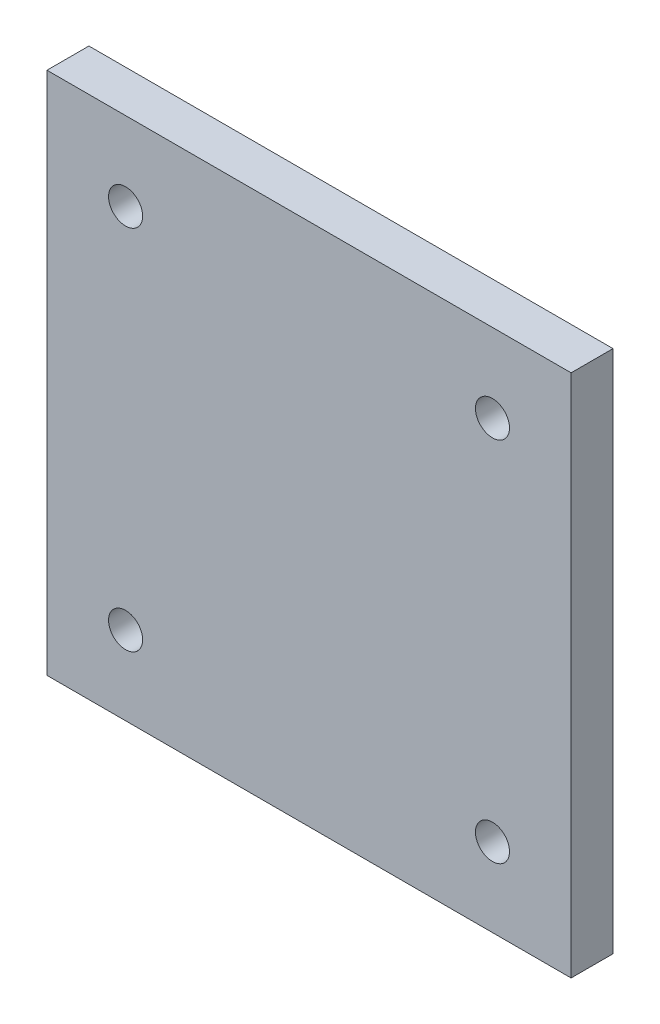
ISO-10303-21;
HEADER;
FILE_DESCRIPTION(('STEP AP214'),'2;1');
FILE_NAME('part.step','',(''),(''),'','','');
FILE_SCHEMA(('AUTOMOTIVE_DESIGN { 1 0 10303 214 1 1 1 1 }'));
ENDSEC;
DATA;
#1=APPLICATION_CONTEXT('core data for automotive mechanical design processes');
#2=APPLICATION_PROTOCOL_DEFINITION('international standard','automotive_design',2000,#1);
#3=PRODUCT_CONTEXT('',#1,'mechanical');
#4=PRODUCT('Part','Part','',(#3));
#5=PRODUCT_RELATED_PRODUCT_CATEGORY('part','',(#4));
#6=PRODUCT_DEFINITION_FORMATION('','',#4);
#7=PRODUCT_DEFINITION_CONTEXT('part definition',#1,'design');
#8=PRODUCT_DEFINITION('design','',#6,#7);
#9=PRODUCT_DEFINITION_SHAPE('','',#8);
#10=(LENGTH_UNIT() NAMED_UNIT(*) SI_UNIT(.MILLI.,.METRE.));
#11=(NAMED_UNIT(*) PLANE_ANGLE_UNIT() SI_UNIT($,.RADIAN.));
#12=(NAMED_UNIT(*) SI_UNIT($,.STERADIAN.) SOLID_ANGLE_UNIT());
#13=UNCERTAINTY_MEASURE_WITH_UNIT(LENGTH_MEASURE(1.E-05),#10,'distance_accuracy_value','');
#14=(GEOMETRIC_REPRESENTATION_CONTEXT(3) GLOBAL_UNCERTAINTY_ASSIGNED_CONTEXT((#13)) GLOBAL_UNIT_ASSIGNED_CONTEXT((#10,
#11,#12)) REPRESENTATION_CONTEXT('',''));
#15=CARTESIAN_POINT('',(0.,0.,0.));
#16=DIRECTION('',(0.,0.,1.));
#17=DIRECTION('',(1.,0.,0.));
#18=AXIS2_PLACEMENT_3D('',#15,#16,#17);
#19=CARTESIAN_POINT('',(0.,0.,16.));
#20=DIRECTION('',(0.,0.,1.));
#21=DIRECTION('',(1.,0.,0.));
#22=AXIS2_PLACEMENT_3D('',#19,#20,#21);
#23=PLANE('',#22);
#24=CARTESIAN_POINT('',(70.,70.,16.));
#25=DIRECTION('',(0.,0.,1.));
#26=DIRECTION('',(1.,0.,0.));
#27=AXIS2_PLACEMENT_3D('',#24,#25,#26);
#28=CIRCLE('',#27,6.5);
#29=CARTESIAN_POINT('',(76.5,70.,16.));
#30=VERTEX_POINT('',#29);
#31=EDGE_CURVE('E24',#30,#30,#28,.T.);
#32=ORIENTED_EDGE('',*,*,#31,.F.);
#33=EDGE_LOOP('',(#32));
#34=FACE_BOUND('',#33,.T.);
#35=CARTESIAN_POINT('',(-70.,70.,16.));
#36=DIRECTION('',(0.,0.,1.));
#37=DIRECTION('',(1.,0.,0.));
#38=AXIS2_PLACEMENT_3D('',#35,#36,#37);
#39=CIRCLE('',#38,6.5);
#40=CARTESIAN_POINT('',(-63.5,70.,16.));
#41=VERTEX_POINT('',#40);
#42=EDGE_CURVE('E121',#41,#41,#39,.T.);
#43=ORIENTED_EDGE('',*,*,#42,.F.);
#44=EDGE_LOOP('',(#43));
#45=FACE_BOUND('',#44,.T.);
#46=CARTESIAN_POINT('',(70.,-70.,16.));
#47=DIRECTION('',(0.,0.,1.));
#48=DIRECTION('',(1.,0.,0.));
#49=AXIS2_PLACEMENT_3D('',#46,#47,#48);
#50=CIRCLE('',#49,6.5);
#51=CARTESIAN_POINT('',(76.5,-70.,16.));
#52=VERTEX_POINT('',#51);
#53=EDGE_CURVE('E99',#52,#52,#50,.T.);
#54=ORIENTED_EDGE('',*,*,#53,.F.);
#55=EDGE_LOOP('',(#54));
#56=FACE_BOUND('',#55,.T.);
#57=CARTESIAN_POINT('',(-70.,-70.,16.));
#58=DIRECTION('',(0.,0.,1.));
#59=DIRECTION('',(1.,0.,0.));
#60=AXIS2_PLACEMENT_3D('',#57,#58,#59);
#61=CIRCLE('',#60,6.5);
#62=CARTESIAN_POINT('',(-63.5,-70.,16.));
#63=VERTEX_POINT('',#62);
#64=EDGE_CURVE('E271',#63,#63,#61,.T.);
#65=ORIENTED_EDGE('',*,*,#64,.F.);
#66=EDGE_LOOP('',(#65));
#67=FACE_BOUND('',#66,.T.);
#68=DIRECTION('',(1.,0.,0.));
#69=VECTOR('',#68,1.);
#70=CARTESIAN_POINT('',(-100.,-100.,16.));
#71=LINE('',#70,#69);
#72=CARTESIAN_POINT('',(-100.,-100.,16.));
#73=VERTEX_POINT('',#72);
#74=CARTESIAN_POINT('',(100.,-100.,16.));
#75=VERTEX_POINT('',#74);
#76=EDGE_CURVE('E240',#73,#75,#71,.T.);
#77=ORIENTED_EDGE('',*,*,#76,.T.);
#78=DIRECTION('',(0.,1.,0.));
#79=VECTOR('',#78,1.);
#80=CARTESIAN_POINT('',(100.,-100.,16.));
#81=LINE('',#80,#79);
#82=CARTESIAN_POINT('',(100.,100.,16.));
#83=VERTEX_POINT('',#82);
#84=EDGE_CURVE('E264',#75,#83,#81,.T.);
#85=ORIENTED_EDGE('',*,*,#84,.T.);
#86=DIRECTION('',(-1.,0.,0.));
#87=VECTOR('',#86,1.);
#88=CARTESIAN_POINT('',(100.,100.,16.));
#89=LINE('',#88,#87);
#90=CARTESIAN_POINT('',(-100.,100.,16.));
#91=VERTEX_POINT('',#90);
#92=EDGE_CURVE('E234',#83,#91,#89,.T.);
#93=ORIENTED_EDGE('',*,*,#92,.T.);
#94=DIRECTION('',(0.,-1.,0.));
#95=VECTOR('',#94,1.);
#96=CARTESIAN_POINT('',(-100.,100.,16.));
#97=LINE('',#96,#95);
#98=EDGE_CURVE('E233',#91,#73,#97,.T.);
#99=ORIENTED_EDGE('',*,*,#98,.T.);
#100=EDGE_LOOP('',(#77,#85,#93,#99));
#101=FACE_BOUND('',#100,.T.);
#102=ADVANCED_FACE('F16',(#34,#45,#56,#67,#101),#23,.T.);
#103=CARTESIAN_POINT('',(0.,0.,0.));
#104=DIRECTION('',(0.,0.,1.));
#105=DIRECTION('',(1.,0.,0.));
#106=AXIS2_PLACEMENT_3D('',#103,#104,#105);
#107=PLANE('',#106);
#108=CARTESIAN_POINT('',(70.,70.,0.));
#109=DIRECTION('',(0.,0.,1.));
#110=DIRECTION('',(1.,0.,0.));
#111=AXIS2_PLACEMENT_3D('',#108,#109,#110);
#112=CIRCLE('',#111,6.5);
#113=CARTESIAN_POINT('',(76.5,70.,0.));
#114=VERTEX_POINT('',#113);
#115=EDGE_CURVE('E10',#114,#114,#112,.T.);
#116=ORIENTED_EDGE('',*,*,#115,.T.);
#117=EDGE_LOOP('',(#116));
#118=FACE_BOUND('',#117,.T.);
#119=CARTESIAN_POINT('',(-70.,70.,0.));
#120=DIRECTION('',(0.,0.,1.));
#121=DIRECTION('',(1.,0.,0.));
#122=AXIS2_PLACEMENT_3D('',#119,#120,#121);
#123=CIRCLE('',#122,6.5);
#124=CARTESIAN_POINT('',(-63.5,70.,0.));
#125=VERTEX_POINT('',#124);
#126=EDGE_CURVE('E124',#125,#125,#123,.T.);
#127=ORIENTED_EDGE('',*,*,#126,.T.);
#128=EDGE_LOOP('',(#127));
#129=FACE_BOUND('',#128,.T.);
#130=CARTESIAN_POINT('',(70.,-70.,0.));
#131=DIRECTION('',(0.,0.,1.));
#132=DIRECTION('',(1.,0.,0.));
#133=AXIS2_PLACEMENT_3D('',#130,#131,#132);
#134=CIRCLE('',#133,6.5);
#135=CARTESIAN_POINT('',(76.5,-70.,0.));
#136=VERTEX_POINT('',#135);
#137=EDGE_CURVE('E105',#136,#136,#134,.T.);
#138=ORIENTED_EDGE('',*,*,#137,.T.);
#139=EDGE_LOOP('',(#138));
#140=FACE_BOUND('',#139,.T.);
#141=CARTESIAN_POINT('',(-70.,-70.,0.));
#142=DIRECTION('',(0.,0.,1.));
#143=DIRECTION('',(1.,0.,0.));
#144=AXIS2_PLACEMENT_3D('',#141,#142,#143);
#145=CIRCLE('',#144,6.5);
#146=CARTESIAN_POINT('',(-63.5,-70.,0.));
#147=VERTEX_POINT('',#146);
#148=EDGE_CURVE('E113',#147,#147,#145,.T.);
#149=ORIENTED_EDGE('',*,*,#148,.T.);
#150=EDGE_LOOP('',(#149));
#151=FACE_BOUND('',#150,.T.);
#152=DIRECTION('',(0.,-1.,0.));
#153=VECTOR('',#152,1.);
#154=CARTESIAN_POINT('',(-100.,100.,0.));
#155=LINE('',#154,#153);
#156=CARTESIAN_POINT('',(-100.,100.,0.));
#157=VERTEX_POINT('',#156);
#158=CARTESIAN_POINT('',(-100.,-100.,0.));
#159=VERTEX_POINT('',#158);
#160=EDGE_CURVE('E223',#157,#159,#155,.T.);
#161=ORIENTED_EDGE('',*,*,#160,.F.);
#162=DIRECTION('',(-1.,0.,0.));
#163=VECTOR('',#162,1.);
#164=CARTESIAN_POINT('',(100.,100.,0.));
#165=LINE('',#164,#163);
#166=CARTESIAN_POINT('',(100.,100.,0.));
#167=VERTEX_POINT('',#166);
#168=EDGE_CURVE('E261',#167,#157,#165,.T.);
#169=ORIENTED_EDGE('',*,*,#168,.F.);
#170=DIRECTION('',(0.,1.,0.));
#171=VECTOR('',#170,1.);
#172=CARTESIAN_POINT('',(100.,-100.,0.));
#173=LINE('',#172,#171);
#174=CARTESIAN_POINT('',(100.,-100.,0.));
#175=VERTEX_POINT('',#174);
#176=EDGE_CURVE('E242',#175,#167,#173,.T.);
#177=ORIENTED_EDGE('',*,*,#176,.F.);
#178=DIRECTION('',(1.,0.,0.));
#179=VECTOR('',#178,1.);
#180=CARTESIAN_POINT('',(-100.,-100.,0.));
#181=LINE('',#180,#179);
#182=EDGE_CURVE('E238',#159,#175,#181,.T.);
#183=ORIENTED_EDGE('',*,*,#182,.F.);
#184=EDGE_LOOP('',(#161,#169,#177,#183));
#185=FACE_BOUND('',#184,.T.);
#186=ADVANCED_FACE('F169',(#118,#129,#140,#151,#185),#107,.F.);
#187=CARTESIAN_POINT('',(70.,70.,0.));
#188=DIRECTION('',(0.,0.,-1.));
#189=DIRECTION('',(1.,0.,0.));
#190=AXIS2_PLACEMENT_3D('',#187,#188,#189);
#191=CYLINDRICAL_SURFACE('',#190,6.5);
#192=DIRECTION('',(0.,0.,1.));
#193=VECTOR('',#192,1.);
#194=CARTESIAN_POINT('',(76.5,70.,0.));
#195=LINE('',#194,#193);
#196=EDGE_CURVE('E127',#114,#30,#195,.T.);
#197=ORIENTED_EDGE('',*,*,#196,.T.);
#198=ORIENTED_EDGE('',*,*,#31,.T.);
#199=ORIENTED_EDGE('',*,*,#196,.F.);
#200=ORIENTED_EDGE('',*,*,#115,.F.);
#201=EDGE_LOOP('',(#197,#198,#199,#200));
#202=FACE_BOUND('',#201,.T.);
#203=ADVANCED_FACE('F141',(#202),#191,.F.);
#204=CARTESIAN_POINT('',(-70.,70.,0.));
#205=DIRECTION('',(0.,0.,-1.));
#206=DIRECTION('',(1.,0.,0.));
#207=AXIS2_PLACEMENT_3D('',#204,#205,#206);
#208=CYLINDRICAL_SURFACE('',#207,6.5);
#209=DIRECTION('',(0.,0.,1.));
#210=VECTOR('',#209,1.);
#211=CARTESIAN_POINT('',(-63.5,70.,0.));
#212=LINE('',#211,#210);
#213=EDGE_CURVE('E110',#125,#41,#212,.T.);
#214=ORIENTED_EDGE('',*,*,#213,.T.);
#215=ORIENTED_EDGE('',*,*,#42,.T.);
#216=ORIENTED_EDGE('',*,*,#213,.F.);
#217=ORIENTED_EDGE('',*,*,#126,.F.);
#218=EDGE_LOOP('',(#214,#215,#216,#217));
#219=FACE_BOUND('',#218,.T.);
#220=ADVANCED_FACE('F136',(#219),#208,.F.);
#221=CARTESIAN_POINT('',(70.,-70.,0.));
#222=DIRECTION('',(0.,0.,-1.));
#223=DIRECTION('',(1.,0.,0.));
#224=AXIS2_PLACEMENT_3D('',#221,#222,#223);
#225=CYLINDRICAL_SURFACE('',#224,6.5);
#226=DIRECTION('',(0.,0.,1.));
#227=VECTOR('',#226,1.);
#228=CARTESIAN_POINT('',(76.5,-70.,0.));
#229=LINE('',#228,#227);
#230=EDGE_CURVE('E102',#136,#52,#229,.T.);
#231=ORIENTED_EDGE('',*,*,#230,.T.);
#232=ORIENTED_EDGE('',*,*,#53,.T.);
#233=ORIENTED_EDGE('',*,*,#230,.F.);
#234=ORIENTED_EDGE('',*,*,#137,.F.);
#235=EDGE_LOOP('',(#231,#232,#233,#234));
#236=FACE_BOUND('',#235,.T.);
#237=ADVANCED_FACE('F100',(#236),#225,.F.);
#238=CARTESIAN_POINT('',(-70.,-70.,0.));
#239=DIRECTION('',(0.,0.,-1.));
#240=DIRECTION('',(1.,0.,0.));
#241=AXIS2_PLACEMENT_3D('',#238,#239,#240);
#242=CYLINDRICAL_SURFACE('',#241,6.5);
#243=DIRECTION('',(0.,0.,1.));
#244=VECTOR('',#243,1.);
#245=CARTESIAN_POINT('',(-63.5,-70.,0.));
#246=LINE('',#245,#244);
#247=EDGE_CURVE('E254',#147,#63,#246,.T.);
#248=ORIENTED_EDGE('',*,*,#247,.T.);
#249=ORIENTED_EDGE('',*,*,#64,.T.);
#250=ORIENTED_EDGE('',*,*,#247,.F.);
#251=ORIENTED_EDGE('',*,*,#148,.F.);
#252=EDGE_LOOP('',(#248,#249,#250,#251));
#253=FACE_BOUND('',#252,.T.);
#254=ADVANCED_FACE('F190',(#253),#242,.F.);
#255=CARTESIAN_POINT('',(-100.,100.,0.));
#256=DIRECTION('',(1.,0.,0.));
#257=DIRECTION('',(0.,1.,0.));
#258=AXIS2_PLACEMENT_3D('',#255,#256,#257);
#259=PLANE('',#258);
#260=ORIENTED_EDGE('',*,*,#160,.T.);
#261=DIRECTION('',(0.,0.,1.));
#262=VECTOR('',#261,1.);
#263=CARTESIAN_POINT('',(-100.,-100.,0.));
#264=LINE('',#263,#262);
#265=EDGE_CURVE('E225',#159,#73,#264,.T.);
#266=ORIENTED_EDGE('',*,*,#265,.T.);
#267=ORIENTED_EDGE('',*,*,#98,.F.);
#268=DIRECTION('',(0.,0.,1.));
#269=VECTOR('',#268,1.);
#270=CARTESIAN_POINT('',(-100.,100.,0.));
#271=LINE('',#270,#269);
#272=EDGE_CURVE('E228',#157,#91,#271,.T.);
#273=ORIENTED_EDGE('',*,*,#272,.F.);
#274=EDGE_LOOP('',(#260,#266,#267,#273));
#275=FACE_BOUND('',#274,.T.);
#276=ADVANCED_FACE('F181',(#275),#259,.F.);
#277=CARTESIAN_POINT('',(100.,100.,0.));
#278=DIRECTION('',(0.,-1.,0.));
#279=DIRECTION('',(0.,0.,-1.));
#280=AXIS2_PLACEMENT_3D('',#277,#278,#279);
#281=PLANE('',#280);
#282=ORIENTED_EDGE('',*,*,#168,.T.);
#283=ORIENTED_EDGE('',*,*,#272,.T.);
#284=ORIENTED_EDGE('',*,*,#92,.F.);
#285=DIRECTION('',(0.,0.,1.));
#286=VECTOR('',#285,1.);
#287=CARTESIAN_POINT('',(100.,100.,0.));
#288=LINE('',#287,#286);
#289=EDGE_CURVE('E260',#167,#83,#288,.T.);
#290=ORIENTED_EDGE('',*,*,#289,.F.);
#291=EDGE_LOOP('',(#282,#283,#284,#290));
#292=FACE_BOUND('',#291,.T.);
#293=ADVANCED_FACE('F163',(#292),#281,.F.);
#294=CARTESIAN_POINT('',(100.,-100.,0.));
#295=DIRECTION('',(-1.,0.,0.));
#296=DIRECTION('',(0.,0.,1.));
#297=AXIS2_PLACEMENT_3D('',#294,#295,#296);
#298=PLANE('',#297);
#299=ORIENTED_EDGE('',*,*,#176,.T.);
#300=ORIENTED_EDGE('',*,*,#289,.T.);
#301=ORIENTED_EDGE('',*,*,#84,.F.);
#302=DIRECTION('',(0.,0.,1.));
#303=VECTOR('',#302,1.);
#304=CARTESIAN_POINT('',(100.,-100.,0.));
#305=LINE('',#304,#303);
#306=EDGE_CURVE('E247',#175,#75,#305,.T.);
#307=ORIENTED_EDGE('',*,*,#306,.F.);
#308=EDGE_LOOP('',(#299,#300,#301,#307));
#309=FACE_BOUND('',#308,.T.);
#310=ADVANCED_FACE('F154',(#309),#298,.F.);
#311=CARTESIAN_POINT('',(-100.,-100.,0.));
#312=DIRECTION('',(0.,1.,0.));
#313=DIRECTION('',(1.,0.,0.));
#314=AXIS2_PLACEMENT_3D('',#311,#312,#313);
#315=PLANE('',#314);
#316=ORIENTED_EDGE('',*,*,#182,.T.);
#317=ORIENTED_EDGE('',*,*,#306,.T.);
#318=ORIENTED_EDGE('',*,*,#76,.F.);
#319=ORIENTED_EDGE('',*,*,#265,.F.);
#320=EDGE_LOOP('',(#316,#317,#318,#319));
#321=FACE_BOUND('',#320,.T.);
#322=ADVANCED_FACE('F149',(#321),#315,.F.);
#323=CLOSED_SHELL('',(#102,#186,#203,#220,#237,#254,#276,#293,#310,#322));
#324=MANIFOLD_SOLID_BREP('B1',#323);
#325=ADVANCED_BREP_SHAPE_REPRESENTATION('',(#18,#324),#14);
#326=SHAPE_DEFINITION_REPRESENTATION(#9,#325);
ENDSEC;
END-ISO-10303-21;
